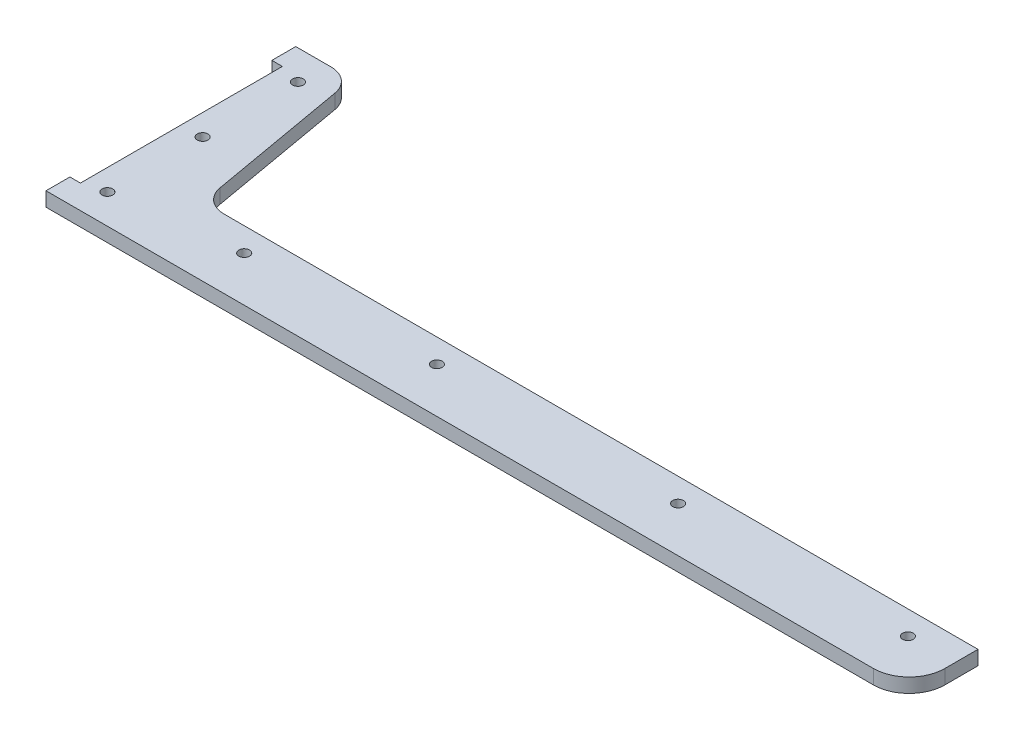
ISO-10303-21;
HEADER;
FILE_DESCRIPTION(('STEP AP214'),'2;1');
FILE_NAME('part.step','',(''),(''),'','','');
FILE_SCHEMA(('AUTOMOTIVE_DESIGN { 1 0 10303 214 1 1 1 1 }'));
ENDSEC;
DATA;
#1=APPLICATION_CONTEXT('core data for automotive mechanical design processes');
#2=APPLICATION_PROTOCOL_DEFINITION('international standard','automotive_design',2000,#1);
#3=PRODUCT_CONTEXT('',#1,'mechanical');
#4=PRODUCT('Part','Part','',(#3));
#5=PRODUCT_RELATED_PRODUCT_CATEGORY('part','',(#4));
#6=PRODUCT_DEFINITION_FORMATION('','',#4);
#7=PRODUCT_DEFINITION_CONTEXT('part definition',#1,'design');
#8=PRODUCT_DEFINITION('design','',#6,#7);
#9=PRODUCT_DEFINITION_SHAPE('','',#8);
#10=(LENGTH_UNIT() NAMED_UNIT(*) SI_UNIT(.MILLI.,.METRE.));
#11=(NAMED_UNIT(*) PLANE_ANGLE_UNIT() SI_UNIT($,.RADIAN.));
#12=(NAMED_UNIT(*) SI_UNIT($,.STERADIAN.) SOLID_ANGLE_UNIT());
#13=UNCERTAINTY_MEASURE_WITH_UNIT(LENGTH_MEASURE(1.E-05),#10,'distance_accuracy_value','');
#14=(GEOMETRIC_REPRESENTATION_CONTEXT(3) GLOBAL_UNCERTAINTY_ASSIGNED_CONTEXT((#13)) GLOBAL_UNIT_ASSIGNED_CONTEXT((#10,
#11,#12)) REPRESENTATION_CONTEXT('',''));
#15=CARTESIAN_POINT('',(0.,0.,0.));
#16=DIRECTION('',(0.,0.,1.));
#17=DIRECTION('',(1.,0.,0.));
#18=AXIS2_PLACEMENT_3D('',#15,#16,#17);
#19=CARTESIAN_POINT('',(0.,2.,0.));
#20=DIRECTION('',(0.,1.,0.));
#21=DIRECTION('',(0.,0.,1.));
#22=AXIS2_PLACEMENT_3D('',#19,#20,#21);
#23=PLANE('',#22);
#24=CARTESIAN_POINT('',(16.,2.,11.));
#25=DIRECTION('',(0.,1.,0.));
#26=DIRECTION('',(0.,0.,1.));
#27=AXIS2_PLACEMENT_3D('',#24,#25,#26);
#28=CIRCLE('',#27,1.5);
#29=CARTESIAN_POINT('',(16.,2.,12.5));
#30=VERTEX_POINT('',#29);
#31=EDGE_CURVE('E250',#30,#30,#28,.F.);
#32=ORIENTED_EDGE('',*,*,#31,.T.);
#33=EDGE_LOOP('',(#32));
#34=FACE_BOUND('',#33,.T.);
#35=CARTESIAN_POINT('',(16.,2.,-15.7));
#36=DIRECTION('',(0.,1.,0.));
#37=DIRECTION('',(0.,0.,1.));
#38=AXIS2_PLACEMENT_3D('',#35,#36,#37);
#39=CIRCLE('',#38,1.5);
#40=CARTESIAN_POINT('',(16.,2.,-14.2));
#41=VERTEX_POINT('',#40);
#42=EDGE_CURVE('E254',#41,#41,#39,.F.);
#43=ORIENTED_EDGE('',*,*,#42,.T.);
#44=EDGE_LOOP('',(#43));
#45=FACE_BOUND('',#44,.T.);
#46=CARTESIAN_POINT('',(16.,2.,-42.4));
#47=DIRECTION('',(0.,1.,0.));
#48=DIRECTION('',(0.,0.,1.));
#49=AXIS2_PLACEMENT_3D('',#46,#47,#48);
#50=CIRCLE('',#49,1.5);
#51=CARTESIAN_POINT('',(16.,2.,-40.9));
#52=VERTEX_POINT('',#51);
#53=EDGE_CURVE('E258',#52,#52,#50,.F.);
#54=ORIENTED_EDGE('',*,*,#53,.T.);
#55=EDGE_LOOP('',(#54));
#56=FACE_BOUND('',#55,.T.);
#57=CARTESIAN_POINT('',(50.,2.,6.65));
#58=DIRECTION('',(0.,1.,0.));
#59=DIRECTION('',(0.,0.,1.));
#60=AXIS2_PLACEMENT_3D('',#57,#58,#59);
#61=CIRCLE('',#60,1.5);
#62=CARTESIAN_POINT('',(50.,2.,8.15));
#63=VERTEX_POINT('',#62);
#64=EDGE_CURVE('E262',#63,#63,#61,.F.);
#65=ORIENTED_EDGE('',*,*,#64,.T.);
#66=EDGE_LOOP('',(#65));
#67=FACE_BOUND('',#66,.T.);
#68=CARTESIAN_POINT('',(104.,2.,6.65));
#69=DIRECTION('',(0.,1.,0.));
#70=DIRECTION('',(0.,0.,1.));
#71=AXIS2_PLACEMENT_3D('',#68,#69,#70);
#72=CIRCLE('',#71,1.5);
#73=CARTESIAN_POINT('',(104.,2.,8.15));
#74=VERTEX_POINT('',#73);
#75=EDGE_CURVE('E266',#74,#74,#72,.F.);
#76=ORIENTED_EDGE('',*,*,#75,.T.);
#77=EDGE_LOOP('',(#76));
#78=FACE_BOUND('',#77,.T.);
#79=CARTESIAN_POINT('',(171.6,2.,6.65));
#80=DIRECTION('',(0.,1.,0.));
#81=DIRECTION('',(0.,0.,1.));
#82=AXIS2_PLACEMENT_3D('',#79,#80,#81);
#83=CIRCLE('',#82,1.5);
#84=CARTESIAN_POINT('',(171.6,2.,8.15));
#85=VERTEX_POINT('',#84);
#86=EDGE_CURVE('E270',#85,#85,#83,.F.);
#87=ORIENTED_EDGE('',*,*,#86,.T.);
#88=EDGE_LOOP('',(#87));
#89=FACE_BOUND('',#88,.T.);
#90=CARTESIAN_POINT('',(236.,2.,6.65));
#91=DIRECTION('',(0.,1.,0.));
#92=DIRECTION('',(0.,0.,1.));
#93=AXIS2_PLACEMENT_3D('',#90,#91,#92);
#94=CIRCLE('',#93,1.5);
#95=CARTESIAN_POINT('',(236.,2.,8.15));
#96=VERTEX_POINT('',#95);
#97=EDGE_CURVE('E159',#96,#96,#94,.F.);
#98=ORIENTED_EDGE('',*,*,#97,.T.);
#99=EDGE_LOOP('',(#98));
#100=FACE_BOUND('',#99,.T.);
#101=DIRECTION('',(-1.,0.,0.));
#102=VECTOR('',#101,1.);
#103=CARTESIAN_POINT('',(249.,2.,0.));
#104=LINE('',#103,#102);
#105=CARTESIAN_POINT('',(37.67369741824,2.,0.));
#106=VERTEX_POINT('',#105);
#107=CARTESIAN_POINT('',(249.,2.,0.));
#108=VERTEX_POINT('',#107);
#109=EDGE_CURVE('E146',#106,#108,#104,.F.);
#110=ORIENTED_EDGE('',*,*,#109,.F.);
#111=CARTESIAN_POINT('',(37.67369741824,2.,-7.));
#112=DIRECTION('',(0.,1.,0.));
#113=DIRECTION('',(0.,0.,1.));
#114=AXIS2_PLACEMENT_3D('',#111,#112,#113);
#115=CIRCLE('',#114,7.);
#116=CARTESIAN_POINT('',(30.7800431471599,2.,-5.7844627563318));
#117=VERTEX_POINT('',#116);
#118=EDGE_CURVE('E20',#106,#117,#115,.F.);
#119=ORIENTED_EDGE('',*,*,#118,.T.);
#120=DIRECTION('',(-0.173648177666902,0.,-0.984807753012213));
#121=VECTOR('',#120,1.);
#122=CARTESIAN_POINT('',(30.78004314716,2.,-5.784462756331));
#123=LINE('',#122,#121);
#124=CARTESIAN_POINT('',(23.880178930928,2.,-44.9155372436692));
#125=VERTEX_POINT('',#124);
#126=EDGE_CURVE('E144',#125,#117,#123,.F.);
#127=ORIENTED_EDGE('',*,*,#126,.F.);
#128=CARTESIAN_POINT('',(16.98652465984,2.,-43.7));
#129=DIRECTION('',(0.,1.,0.));
#130=DIRECTION('',(0.,0.,1.));
#131=AXIS2_PLACEMENT_3D('',#128,#129,#130);
#132=CIRCLE('',#131,7.);
#133=CARTESIAN_POINT('',(16.98652465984,2.,-50.7));
#134=VERTEX_POINT('',#133);
#135=EDGE_CURVE('E280',#134,#125,#132,.F.);
#136=ORIENTED_EDGE('',*,*,#135,.F.);
#137=DIRECTION('',(-1.,0.,0.));
#138=VECTOR('',#137,1.);
#139=CARTESIAN_POINT('',(16.98652465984,2.,-50.7));
#140=LINE('',#139,#138);
#141=CARTESIAN_POINT('',(7.1,2.,-50.7));
#142=VERTEX_POINT('',#141);
#143=EDGE_CURVE('E204',#142,#134,#140,.F.);
#144=ORIENTED_EDGE('',*,*,#143,.F.);
#145=DIRECTION('',(0.,0.,1.));
#146=VECTOR('',#145,1.);
#147=CARTESIAN_POINT('',(7.1,2.,-50.7));
#148=LINE('',#147,#146);
#149=CARTESIAN_POINT('',(7.1,2.,-44.));
#150=VERTEX_POINT('',#149);
#151=EDGE_CURVE('E198',#150,#142,#148,.F.);
#152=ORIENTED_EDGE('',*,*,#151,.F.);
#153=DIRECTION('',(1.,0.,0.));
#154=VECTOR('',#153,1.);
#155=CARTESIAN_POINT('',(7.1,2.,-44.));
#156=LINE('',#155,#154);
#157=CARTESIAN_POINT('',(10.05,2.,-44.));
#158=VERTEX_POINT('',#157);
#159=EDGE_CURVE('E192',#158,#150,#156,.F.);
#160=ORIENTED_EDGE('',*,*,#159,.F.);
#161=DIRECTION('',(0.,0.,1.));
#162=VECTOR('',#161,1.);
#163=CARTESIAN_POINT('',(10.05,2.,-44.));
#164=LINE('',#163,#162);
#165=CARTESIAN_POINT('',(10.05,2.,12.6));
#166=VERTEX_POINT('',#165);
#167=EDGE_CURVE('E186',#166,#158,#164,.F.);
#168=ORIENTED_EDGE('',*,*,#167,.F.);
#169=DIRECTION('',(-1.,0.,0.));
#170=VECTOR('',#169,1.);
#171=CARTESIAN_POINT('',(10.05,2.,12.6));
#172=LINE('',#171,#170);
#173=CARTESIAN_POINT('',(7.1,2.,12.6));
#174=VERTEX_POINT('',#173);
#175=EDGE_CURVE('E180',#174,#166,#172,.F.);
#176=ORIENTED_EDGE('',*,*,#175,.F.);
#177=DIRECTION('',(0.,0.,1.));
#178=VECTOR('',#177,1.);
#179=CARTESIAN_POINT('',(7.1,2.,12.6));
#180=LINE('',#179,#178);
#181=CARTESIAN_POINT('',(7.1,2.,19.3));
#182=VERTEX_POINT('',#181);
#183=EDGE_CURVE('E174',#182,#174,#180,.F.);
#184=ORIENTED_EDGE('',*,*,#183,.F.);
#185=DIRECTION('',(1.,0.,0.));
#186=VECTOR('',#185,1.);
#187=CARTESIAN_POINT('',(7.1,2.,19.3));
#188=LINE('',#187,#186);
#189=CARTESIAN_POINT('',(239.,2.,19.3));
#190=VERTEX_POINT('',#189);
#191=EDGE_CURVE('E167',#190,#182,#188,.F.);
#192=ORIENTED_EDGE('',*,*,#191,.F.);
#193=CARTESIAN_POINT('',(239.,2.,9.3));
#194=DIRECTION('',(0.,1.,0.));
#195=DIRECTION('',(0.,0.,1.));
#196=AXIS2_PLACEMENT_3D('',#193,#194,#195);
#197=CIRCLE('',#196,10.);
#198=CARTESIAN_POINT('',(249.,2.,9.3));
#199=VERTEX_POINT('',#198);
#200=EDGE_CURVE('E277',#199,#190,#197,.F.);
#201=ORIENTED_EDGE('',*,*,#200,.F.);
#202=DIRECTION('',(0.,0.,-1.));
#203=VECTOR('',#202,1.);
#204=CARTESIAN_POINT('',(249.,2.,9.3));
#205=LINE('',#204,#203);
#206=EDGE_CURVE('E153',#108,#199,#205,.F.);
#207=ORIENTED_EDGE('',*,*,#206,.F.);
#208=EDGE_LOOP('',(#110,#119,#127,#136,#144,#152,#160,#168,#176,#184,#192,#201,#207));
#209=FACE_BOUND('',#208,.T.);
#210=ADVANCED_FACE('F17',(#34,#45,#56,#67,#78,#89,#100,#209),#23,.T.);
#211=CARTESIAN_POINT('',(37.67369741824,-2.,-7.));
#212=DIRECTION('',(0.,1.,0.));
#213=DIRECTION('',(0.,0.,1.));
#214=AXIS2_PLACEMENT_3D('',#211,#212,#213);
#215=CYLINDRICAL_SURFACE('',#214,7.);
#216=ORIENTED_EDGE('',*,*,#118,.F.);
#217=DIRECTION('',(0.,1.,0.));
#218=VECTOR('',#217,1.);
#219=CARTESIAN_POINT('',(37.67369741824,-2.,0.));
#220=LINE('',#219,#218);
#221=CARTESIAN_POINT('',(37.67369741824,-2.,0.));
#222=VERTEX_POINT('',#221);
#223=EDGE_CURVE('E138',#222,#106,#220,.T.);
#224=ORIENTED_EDGE('',*,*,#223,.F.);
#225=CARTESIAN_POINT('',(37.67369741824,-2.,-7.));
#226=DIRECTION('',(0.,1.,0.));
#227=DIRECTION('',(0.,0.,1.));
#228=AXIS2_PLACEMENT_3D('',#225,#226,#227);
#229=CIRCLE('',#228,7.);
#230=CARTESIAN_POINT('',(30.7800431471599,-2.,-5.78446275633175));
#231=VERTEX_POINT('',#230);
#232=EDGE_CURVE('E248',#222,#231,#229,.F.);
#233=ORIENTED_EDGE('',*,*,#232,.T.);
#234=DIRECTION('',(0.,1.,0.));
#235=VECTOR('',#234,1.);
#236=CARTESIAN_POINT('',(30.78004314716,-2.,-5.784462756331));
#237=LINE('',#236,#235);
#238=EDGE_CURVE('E139',#117,#231,#237,.F.);
#239=ORIENTED_EDGE('',*,*,#238,.F.);
#240=EDGE_LOOP('',(#216,#224,#233,#239));
#241=FACE_BOUND('',#240,.T.);
#242=ADVANCED_FACE('F136',(#241),#215,.F.);
#243=CARTESIAN_POINT('',(30.78004314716,-2.,-5.784462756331));
#244=DIRECTION('',(0.984807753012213,0.,-0.173648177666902));
#245=DIRECTION('',(-0.173648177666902,0.,-0.984807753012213));
#246=AXIS2_PLACEMENT_3D('',#243,#244,#245);
#247=PLANE('',#246);
#248=ORIENTED_EDGE('',*,*,#238,.T.);
#249=DIRECTION('',(-0.173648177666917,0.,-0.98480775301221));
#250=VECTOR('',#249,1.);
#251=CARTESIAN_POINT('',(30.78004314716,-2.,-5.784462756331));
#252=LINE('',#251,#250);
#253=CARTESIAN_POINT('',(23.8801789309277,-2.,-44.9155372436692));
#254=VERTEX_POINT('',#253);
#255=EDGE_CURVE('E247',#231,#254,#252,.T.);
#256=ORIENTED_EDGE('',*,*,#255,.T.);
#257=DIRECTION('',(0.,1.,0.));
#258=VECTOR('',#257,1.);
#259=CARTESIAN_POINT('',(23.8801789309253,-2.,-44.9155372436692));
#260=LINE('',#259,#258);
#261=EDGE_CURVE('E207',#125,#254,#260,.F.);
#262=ORIENTED_EDGE('',*,*,#261,.F.);
#263=ORIENTED_EDGE('',*,*,#126,.T.);
#264=EDGE_LOOP('',(#248,#256,#262,#263));
#265=FACE_BOUND('',#264,.T.);
#266=ADVANCED_FACE('F373',(#265),#247,.T.);
#267=CARTESIAN_POINT('',(16.98652465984,-2.,-43.7));
#268=DIRECTION('',(0.,1.,0.));
#269=DIRECTION('',(0.,0.,1.));
#270=AXIS2_PLACEMENT_3D('',#267,#268,#269);
#271=CYLINDRICAL_SURFACE('',#270,7.);
#272=ORIENTED_EDGE('',*,*,#261,.T.);
#273=CARTESIAN_POINT('',(16.98652465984,-2.,-43.7));
#274=DIRECTION('',(0.,1.,0.));
#275=DIRECTION('',(0.,0.,1.));
#276=AXIS2_PLACEMENT_3D('',#273,#274,#275);
#277=CIRCLE('',#276,7.);
#278=CARTESIAN_POINT('',(16.98652465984,-2.,-50.7));
#279=VERTEX_POINT('',#278);
#280=EDGE_CURVE('E242',#254,#279,#277,.T.);
#281=ORIENTED_EDGE('',*,*,#280,.T.);
#282=DIRECTION('',(0.,1.,0.));
#283=VECTOR('',#282,1.);
#284=CARTESIAN_POINT('',(16.98652465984,-2.,-50.7));
#285=LINE('',#284,#283);
#286=EDGE_CURVE('E201',#134,#279,#285,.F.);
#287=ORIENTED_EDGE('',*,*,#286,.F.);
#288=ORIENTED_EDGE('',*,*,#135,.T.);
#289=EDGE_LOOP('',(#272,#281,#287,#288));
#290=FACE_BOUND('',#289,.T.);
#291=ADVANCED_FACE('F371',(#290),#271,.T.);
#292=CARTESIAN_POINT('',(16.98652465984,-2.,-50.7));
#293=DIRECTION('',(0.,0.,-1.));
#294=DIRECTION('',(-1.,0.,0.));
#295=AXIS2_PLACEMENT_3D('',#292,#293,#294);
#296=PLANE('',#295);
#297=ORIENTED_EDGE('',*,*,#286,.T.);
#298=DIRECTION('',(1.,0.,0.));
#299=VECTOR('',#298,1.);
#300=CARTESIAN_POINT('',(0.,-2.,-50.7));
#301=LINE('',#300,#299);
#302=CARTESIAN_POINT('',(7.1,-2.,-50.7));
#303=VERTEX_POINT('',#302);
#304=EDGE_CURVE('E246',#279,#303,#301,.F.);
#305=ORIENTED_EDGE('',*,*,#304,.T.);
#306=DIRECTION('',(0.,1.,0.));
#307=VECTOR('',#306,1.);
#308=CARTESIAN_POINT('',(7.1,-2.,-50.7));
#309=LINE('',#308,#307);
#310=EDGE_CURVE('E195',#142,#303,#309,.F.);
#311=ORIENTED_EDGE('',*,*,#310,.F.);
#312=ORIENTED_EDGE('',*,*,#143,.T.);
#313=EDGE_LOOP('',(#297,#305,#311,#312));
#314=FACE_BOUND('',#313,.T.);
#315=ADVANCED_FACE('F360',(#314),#296,.T.);
#316=CARTESIAN_POINT('',(7.1,-2.,-50.7));
#317=DIRECTION('',(-1.,0.,0.));
#318=DIRECTION('',(0.,0.,1.));
#319=AXIS2_PLACEMENT_3D('',#316,#317,#318);
#320=PLANE('',#319);
#321=ORIENTED_EDGE('',*,*,#310,.T.);
#322=DIRECTION('',(0.,0.,1.));
#323=VECTOR('',#322,1.);
#324=CARTESIAN_POINT('',(7.1,-2.,0.));
#325=LINE('',#324,#323);
#326=CARTESIAN_POINT('',(7.1,-2.,-44.));
#327=VERTEX_POINT('',#326);
#328=EDGE_CURVE('E341',#303,#327,#325,.T.);
#329=ORIENTED_EDGE('',*,*,#328,.T.);
#330=DIRECTION('',(0.,1.,0.));
#331=VECTOR('',#330,1.);
#332=CARTESIAN_POINT('',(7.1,-2.,-44.));
#333=LINE('',#332,#331);
#334=EDGE_CURVE('E189',#150,#327,#333,.F.);
#335=ORIENTED_EDGE('',*,*,#334,.F.);
#336=ORIENTED_EDGE('',*,*,#151,.T.);
#337=EDGE_LOOP('',(#321,#329,#335,#336));
#338=FACE_BOUND('',#337,.T.);
#339=ADVANCED_FACE('F424',(#338),#320,.T.);
#340=CARTESIAN_POINT('',(7.1,-2.,-44.));
#341=DIRECTION('',(0.,0.,1.));
#342=DIRECTION('',(1.,0.,0.));
#343=AXIS2_PLACEMENT_3D('',#340,#341,#342);
#344=PLANE('',#343);
#345=ORIENTED_EDGE('',*,*,#334,.T.);
#346=DIRECTION('',(1.,0.,0.));
#347=VECTOR('',#346,1.);
#348=CARTESIAN_POINT('',(0.,-2.,-44.));
#349=LINE('',#348,#347);
#350=CARTESIAN_POINT('',(10.05,-2.,-44.));
#351=VERTEX_POINT('',#350);
#352=EDGE_CURVE('E331',#327,#351,#349,.T.);
#353=ORIENTED_EDGE('',*,*,#352,.T.);
#354=DIRECTION('',(0.,1.,0.));
#355=VECTOR('',#354,1.);
#356=CARTESIAN_POINT('',(10.05,-2.,-44.));
#357=LINE('',#356,#355);
#358=EDGE_CURVE('E183',#158,#351,#357,.F.);
#359=ORIENTED_EDGE('',*,*,#358,.F.);
#360=ORIENTED_EDGE('',*,*,#159,.T.);
#361=EDGE_LOOP('',(#345,#353,#359,#360));
#362=FACE_BOUND('',#361,.T.);
#363=ADVANCED_FACE('F420',(#362),#344,.T.);
#364=CARTESIAN_POINT('',(10.05,-2.,-44.));
#365=DIRECTION('',(-1.,0.,0.));
#366=DIRECTION('',(0.,0.,1.));
#367=AXIS2_PLACEMENT_3D('',#364,#365,#366);
#368=PLANE('',#367);
#369=ORIENTED_EDGE('',*,*,#358,.T.);
#370=DIRECTION('',(0.,0.,1.));
#371=VECTOR('',#370,1.);
#372=CARTESIAN_POINT('',(10.05,-2.,0.));
#373=LINE('',#372,#371);
#374=CARTESIAN_POINT('',(10.05,-2.,12.6));
#375=VERTEX_POINT('',#374);
#376=EDGE_CURVE('E321',#351,#375,#373,.T.);
#377=ORIENTED_EDGE('',*,*,#376,.T.);
#378=DIRECTION('',(0.,1.,0.));
#379=VECTOR('',#378,1.);
#380=CARTESIAN_POINT('',(10.05,-2.,12.6));
#381=LINE('',#380,#379);
#382=EDGE_CURVE('E177',#166,#375,#381,.F.);
#383=ORIENTED_EDGE('',*,*,#382,.F.);
#384=ORIENTED_EDGE('',*,*,#167,.T.);
#385=EDGE_LOOP('',(#369,#377,#383,#384));
#386=FACE_BOUND('',#385,.T.);
#387=ADVANCED_FACE('F416',(#386),#368,.T.);
#388=CARTESIAN_POINT('',(10.05,-2.,12.6));
#389=DIRECTION('',(0.,0.,-1.));
#390=DIRECTION('',(-1.,0.,0.));
#391=AXIS2_PLACEMENT_3D('',#388,#389,#390);
#392=PLANE('',#391);
#393=ORIENTED_EDGE('',*,*,#382,.T.);
#394=DIRECTION('',(1.,0.,0.));
#395=VECTOR('',#394,1.);
#396=CARTESIAN_POINT('',(0.,-2.,12.6));
#397=LINE('',#396,#395);
#398=CARTESIAN_POINT('',(7.1,-2.,12.6));
#399=VERTEX_POINT('',#398);
#400=EDGE_CURVE('E311',#375,#399,#397,.F.);
#401=ORIENTED_EDGE('',*,*,#400,.T.);
#402=DIRECTION('',(0.,1.,0.));
#403=VECTOR('',#402,1.);
#404=CARTESIAN_POINT('',(7.1,-2.,12.6));
#405=LINE('',#404,#403);
#406=EDGE_CURVE('E171',#174,#399,#405,.F.);
#407=ORIENTED_EDGE('',*,*,#406,.F.);
#408=ORIENTED_EDGE('',*,*,#175,.T.);
#409=EDGE_LOOP('',(#393,#401,#407,#408));
#410=FACE_BOUND('',#409,.T.);
#411=ADVANCED_FACE('F411',(#410),#392,.T.);
#412=CARTESIAN_POINT('',(7.1,-2.,12.6));
#413=DIRECTION('',(-1.,0.,0.));
#414=DIRECTION('',(0.,0.,1.));
#415=AXIS2_PLACEMENT_3D('',#412,#413,#414);
#416=PLANE('',#415);
#417=ORIENTED_EDGE('',*,*,#406,.T.);
#418=DIRECTION('',(0.,0.,1.));
#419=VECTOR('',#418,1.);
#420=CARTESIAN_POINT('',(7.1,-2.,0.));
#421=LINE('',#420,#419);
#422=CARTESIAN_POINT('',(7.1,-2.,19.3));
#423=VERTEX_POINT('',#422);
#424=EDGE_CURVE('E307',#399,#423,#421,.T.);
#425=ORIENTED_EDGE('',*,*,#424,.T.);
#426=DIRECTION('',(0.,1.,0.));
#427=VECTOR('',#426,1.);
#428=CARTESIAN_POINT('',(7.1,-2.,19.3));
#429=LINE('',#428,#427);
#430=EDGE_CURVE('E170',#182,#423,#429,.F.);
#431=ORIENTED_EDGE('',*,*,#430,.F.);
#432=ORIENTED_EDGE('',*,*,#183,.T.);
#433=EDGE_LOOP('',(#417,#425,#431,#432));
#434=FACE_BOUND('',#433,.T.);
#435=ADVANCED_FACE('F408',(#434),#416,.T.);
#436=CARTESIAN_POINT('',(7.1,-2.,19.3));
#437=DIRECTION('',(0.,0.,1.));
#438=DIRECTION('',(1.,0.,0.));
#439=AXIS2_PLACEMENT_3D('',#436,#437,#438);
#440=PLANE('',#439);
#441=ORIENTED_EDGE('',*,*,#430,.T.);
#442=DIRECTION('',(1.,0.,0.));
#443=VECTOR('',#442,1.);
#444=CARTESIAN_POINT('',(0.,-2.,19.3));
#445=LINE('',#444,#443);
#446=CARTESIAN_POINT('',(239.,-2.,19.3));
#447=VERTEX_POINT('',#446);
#448=EDGE_CURVE('E241',#423,#447,#445,.T.);
#449=ORIENTED_EDGE('',*,*,#448,.T.);
#450=DIRECTION('',(0.,1.,0.));
#451=VECTOR('',#450,1.);
#452=CARTESIAN_POINT('',(239.,-2.,19.3));
#453=LINE('',#452,#451);
#454=EDGE_CURVE('E279',#190,#447,#453,.F.);
#455=ORIENTED_EDGE('',*,*,#454,.F.);
#456=ORIENTED_EDGE('',*,*,#191,.T.);
#457=EDGE_LOOP('',(#441,#449,#455,#456));
#458=FACE_BOUND('',#457,.T.);
#459=ADVANCED_FACE('F404',(#458),#440,.T.);
#460=CARTESIAN_POINT('',(239.,-2.,9.3));
#461=DIRECTION('',(0.,1.,0.));
#462=DIRECTION('',(0.,0.,1.));
#463=AXIS2_PLACEMENT_3D('',#460,#461,#462);
#464=CYLINDRICAL_SURFACE('',#463,10.);
#465=ORIENTED_EDGE('',*,*,#454,.T.);
#466=CARTESIAN_POINT('',(239.,-2.,9.3));
#467=DIRECTION('',(0.,1.,0.));
#468=DIRECTION('',(0.,0.,1.));
#469=AXIS2_PLACEMENT_3D('',#466,#467,#468);
#470=CIRCLE('',#469,10.);
#471=CARTESIAN_POINT('',(249.,-2.,9.3));
#472=VERTEX_POINT('',#471);
#473=EDGE_CURVE('E236',#447,#472,#470,.T.);
#474=ORIENTED_EDGE('',*,*,#473,.T.);
#475=DIRECTION('',(0.,1.,0.));
#476=VECTOR('',#475,1.);
#477=CARTESIAN_POINT('',(249.,-2.,9.3));
#478=LINE('',#477,#476);
#479=EDGE_CURVE('E150',#199,#472,#478,.F.);
#480=ORIENTED_EDGE('',*,*,#479,.F.);
#481=ORIENTED_EDGE('',*,*,#200,.T.);
#482=EDGE_LOOP('',(#465,#474,#480,#481));
#483=FACE_BOUND('',#482,.T.);
#484=ADVANCED_FACE('F398',(#483),#464,.T.);
#485=CARTESIAN_POINT('',(249.,-2.,9.3));
#486=DIRECTION('',(1.,0.,0.));
#487=DIRECTION('',(0.,0.,-1.));
#488=AXIS2_PLACEMENT_3D('',#485,#486,#487);
#489=PLANE('',#488);
#490=ORIENTED_EDGE('',*,*,#479,.T.);
#491=DIRECTION('',(0.,0.,1.));
#492=VECTOR('',#491,1.);
#493=CARTESIAN_POINT('',(249.,-2.,0.));
#494=LINE('',#493,#492);
#495=CARTESIAN_POINT('',(249.,-2.,0.));
#496=VERTEX_POINT('',#495);
#497=EDGE_CURVE('E240',#472,#496,#494,.F.);
#498=ORIENTED_EDGE('',*,*,#497,.T.);
#499=DIRECTION('',(0.,1.,0.));
#500=VECTOR('',#499,1.);
#501=CARTESIAN_POINT('',(249.,-2.,0.));
#502=LINE('',#501,#500);
#503=EDGE_CURVE('E40',#108,#496,#502,.F.);
#504=ORIENTED_EDGE('',*,*,#503,.F.);
#505=ORIENTED_EDGE('',*,*,#206,.T.);
#506=EDGE_LOOP('',(#490,#498,#504,#505));
#507=FACE_BOUND('',#506,.T.);
#508=ADVANCED_FACE('F395',(#507),#489,.T.);
#509=CARTESIAN_POINT('',(249.,-2.,0.));
#510=DIRECTION('',(0.,0.,-1.));
#511=DIRECTION('',(-1.,0.,0.));
#512=AXIS2_PLACEMENT_3D('',#509,#510,#511);
#513=PLANE('',#512);
#514=ORIENTED_EDGE('',*,*,#503,.T.);
#515=DIRECTION('',(1.,0.,0.));
#516=VECTOR('',#515,1.);
#517=CARTESIAN_POINT('',(0.,-2.,0.));
#518=LINE('',#517,#516);
#519=EDGE_CURVE('E148',#496,#222,#518,.F.);
#520=ORIENTED_EDGE('',*,*,#519,.T.);
#521=ORIENTED_EDGE('',*,*,#223,.T.);
#522=ORIENTED_EDGE('',*,*,#109,.T.);
#523=EDGE_LOOP('',(#514,#520,#521,#522));
#524=FACE_BOUND('',#523,.T.);
#525=ADVANCED_FACE('F145',(#524),#513,.T.);
#526=CARTESIAN_POINT('',(236.,-2.,6.65));
#527=DIRECTION('',(0.,1.,0.));
#528=DIRECTION('',(0.,0.,1.));
#529=AXIS2_PLACEMENT_3D('',#526,#527,#528);
#530=CYLINDRICAL_SURFACE('',#529,1.5);
#531=ORIENTED_EDGE('',*,*,#97,.F.);
#532=EDGE_LOOP('',(#531));
#533=FACE_BOUND('',#532,.T.);
#534=CARTESIAN_POINT('',(236.,-2.,6.65));
#535=DIRECTION('',(0.,1.,0.));
#536=DIRECTION('',(0.,0.,1.));
#537=AXIS2_PLACEMENT_3D('',#534,#535,#536);
#538=CIRCLE('',#537,1.5);
#539=CARTESIAN_POINT('',(236.,-2.,8.15));
#540=VERTEX_POINT('',#539);
#541=EDGE_CURVE('E232',#540,#540,#538,.F.);
#542=ORIENTED_EDGE('',*,*,#541,.T.);
#543=EDGE_LOOP('',(#542));
#544=FACE_BOUND('',#543,.T.);
#545=ADVANCED_FACE('F466',(#533,#544),#530,.F.);
#546=CARTESIAN_POINT('',(171.6,-2.,6.65));
#547=DIRECTION('',(0.,1.,0.));
#548=DIRECTION('',(0.,0.,1.));
#549=AXIS2_PLACEMENT_3D('',#546,#547,#548);
#550=CYLINDRICAL_SURFACE('',#549,1.5);
#551=ORIENTED_EDGE('',*,*,#86,.F.);
#552=EDGE_LOOP('',(#551));
#553=FACE_BOUND('',#552,.T.);
#554=CARTESIAN_POINT('',(171.6,-2.,6.65));
#555=DIRECTION('',(0.,1.,0.));
#556=DIRECTION('',(0.,0.,1.));
#557=AXIS2_PLACEMENT_3D('',#554,#555,#556);
#558=CIRCLE('',#557,1.5);
#559=CARTESIAN_POINT('',(171.6,-2.,8.15));
#560=VERTEX_POINT('',#559);
#561=EDGE_CURVE('E228',#560,#560,#558,.F.);
#562=ORIENTED_EDGE('',*,*,#561,.T.);
#563=EDGE_LOOP('',(#562));
#564=FACE_BOUND('',#563,.T.);
#565=ADVANCED_FACE('F462',(#553,#564),#550,.F.);
#566=CARTESIAN_POINT('',(104.,-2.,6.65));
#567=DIRECTION('',(0.,1.,0.));
#568=DIRECTION('',(0.,0.,1.));
#569=AXIS2_PLACEMENT_3D('',#566,#567,#568);
#570=CYLINDRICAL_SURFACE('',#569,1.5);
#571=ORIENTED_EDGE('',*,*,#75,.F.);
#572=EDGE_LOOP('',(#571));
#573=FACE_BOUND('',#572,.T.);
#574=CARTESIAN_POINT('',(104.,-2.,6.65));
#575=DIRECTION('',(0.,1.,0.));
#576=DIRECTION('',(0.,0.,1.));
#577=AXIS2_PLACEMENT_3D('',#574,#575,#576);
#578=CIRCLE('',#577,1.5);
#579=CARTESIAN_POINT('',(104.,-2.,8.15));
#580=VERTEX_POINT('',#579);
#581=EDGE_CURVE('E224',#580,#580,#578,.F.);
#582=ORIENTED_EDGE('',*,*,#581,.T.);
#583=EDGE_LOOP('',(#582));
#584=FACE_BOUND('',#583,.T.);
#585=ADVANCED_FACE('F458',(#573,#584),#570,.F.);
#586=CARTESIAN_POINT('',(50.,-2.,6.65));
#587=DIRECTION('',(0.,1.,0.));
#588=DIRECTION('',(0.,0.,1.));
#589=AXIS2_PLACEMENT_3D('',#586,#587,#588);
#590=CYLINDRICAL_SURFACE('',#589,1.5);
#591=ORIENTED_EDGE('',*,*,#64,.F.);
#592=EDGE_LOOP('',(#591));
#593=FACE_BOUND('',#592,.T.);
#594=CARTESIAN_POINT('',(50.,-2.,6.65));
#595=DIRECTION('',(0.,1.,0.));
#596=DIRECTION('',(0.,0.,1.));
#597=AXIS2_PLACEMENT_3D('',#594,#595,#596);
#598=CIRCLE('',#597,1.5);
#599=CARTESIAN_POINT('',(50.,-2.,8.15));
#600=VERTEX_POINT('',#599);
#601=EDGE_CURVE('E220',#600,#600,#598,.F.);
#602=ORIENTED_EDGE('',*,*,#601,.T.);
#603=EDGE_LOOP('',(#602));
#604=FACE_BOUND('',#603,.T.);
#605=ADVANCED_FACE('F454',(#593,#604),#590,.F.);
#606=CARTESIAN_POINT('',(16.,-2.,-42.4));
#607=DIRECTION('',(0.,1.,0.));
#608=DIRECTION('',(0.,0.,1.));
#609=AXIS2_PLACEMENT_3D('',#606,#607,#608);
#610=CYLINDRICAL_SURFACE('',#609,1.5);
#611=ORIENTED_EDGE('',*,*,#53,.F.);
#612=EDGE_LOOP('',(#611));
#613=FACE_BOUND('',#612,.T.);
#614=CARTESIAN_POINT('',(16.,-2.,-42.4));
#615=DIRECTION('',(0.,1.,0.));
#616=DIRECTION('',(0.,0.,1.));
#617=AXIS2_PLACEMENT_3D('',#614,#615,#616);
#618=CIRCLE('',#617,1.5);
#619=CARTESIAN_POINT('',(16.,-2.,-40.9));
#620=VERTEX_POINT('',#619);
#621=EDGE_CURVE('E216',#620,#620,#618,.F.);
#622=ORIENTED_EDGE('',*,*,#621,.T.);
#623=EDGE_LOOP('',(#622));
#624=FACE_BOUND('',#623,.T.);
#625=ADVANCED_FACE('F450',(#613,#624),#610,.F.);
#626=CARTESIAN_POINT('',(16.,-2.,-15.7));
#627=DIRECTION('',(0.,1.,0.));
#628=DIRECTION('',(0.,0.,1.));
#629=AXIS2_PLACEMENT_3D('',#626,#627,#628);
#630=CYLINDRICAL_SURFACE('',#629,1.5);
#631=ORIENTED_EDGE('',*,*,#42,.F.);
#632=EDGE_LOOP('',(#631));
#633=FACE_BOUND('',#632,.T.);
#634=CARTESIAN_POINT('',(16.,-2.,-15.7));
#635=DIRECTION('',(0.,1.,0.));
#636=DIRECTION('',(0.,0.,1.));
#637=AXIS2_PLACEMENT_3D('',#634,#635,#636);
#638=CIRCLE('',#637,1.5);
#639=CARTESIAN_POINT('',(16.,-2.,-14.2));
#640=VERTEX_POINT('',#639);
#641=EDGE_CURVE('E27',#640,#640,#638,.F.);
#642=ORIENTED_EDGE('',*,*,#641,.T.);
#643=EDGE_LOOP('',(#642));
#644=FACE_BOUND('',#643,.T.);
#645=ADVANCED_FACE('F442',(#633,#644),#630,.F.);
#646=CARTESIAN_POINT('',(16.,-2.,11.));
#647=DIRECTION('',(0.,1.,0.));
#648=DIRECTION('',(0.,0.,1.));
#649=AXIS2_PLACEMENT_3D('',#646,#647,#648);
#650=CYLINDRICAL_SURFACE('',#649,1.5);
#651=ORIENTED_EDGE('',*,*,#31,.F.);
#652=EDGE_LOOP('',(#651));
#653=FACE_BOUND('',#652,.T.);
#654=CARTESIAN_POINT('',(16.,-2.,11.));
#655=DIRECTION('',(0.,1.,0.));
#656=DIRECTION('',(0.,0.,1.));
#657=AXIS2_PLACEMENT_3D('',#654,#655,#656);
#658=CIRCLE('',#657,1.5);
#659=CARTESIAN_POINT('',(16.,-2.,12.5));
#660=VERTEX_POINT('',#659);
#661=EDGE_CURVE('E11',#660,#660,#658,.F.);
#662=ORIENTED_EDGE('',*,*,#661,.T.);
#663=EDGE_LOOP('',(#662));
#664=FACE_BOUND('',#663,.T.);
#665=ADVANCED_FACE('F435',(#653,#664),#650,.F.);
#666=CARTESIAN_POINT('',(0.,-2.,0.));
#667=DIRECTION('',(0.,1.,0.));
#668=DIRECTION('',(0.,0.,1.));
#669=AXIS2_PLACEMENT_3D('',#666,#667,#668);
#670=PLANE('',#669);
#671=ORIENTED_EDGE('',*,*,#661,.F.);
#672=EDGE_LOOP('',(#671));
#673=FACE_BOUND('',#672,.T.);
#674=ORIENTED_EDGE('',*,*,#641,.F.);
#675=EDGE_LOOP('',(#674));
#676=FACE_BOUND('',#675,.T.);
#677=ORIENTED_EDGE('',*,*,#621,.F.);
#678=EDGE_LOOP('',(#677));
#679=FACE_BOUND('',#678,.T.);
#680=ORIENTED_EDGE('',*,*,#601,.F.);
#681=EDGE_LOOP('',(#680));
#682=FACE_BOUND('',#681,.T.);
#683=ORIENTED_EDGE('',*,*,#581,.F.);
#684=EDGE_LOOP('',(#683));
#685=FACE_BOUND('',#684,.T.);
#686=ORIENTED_EDGE('',*,*,#561,.F.);
#687=EDGE_LOOP('',(#686));
#688=FACE_BOUND('',#687,.T.);
#689=ORIENTED_EDGE('',*,*,#541,.F.);
#690=EDGE_LOOP('',(#689));
#691=FACE_BOUND('',#690,.T.);
#692=ORIENTED_EDGE('',*,*,#497,.F.);
#693=ORIENTED_EDGE('',*,*,#473,.F.);
#694=ORIENTED_EDGE('',*,*,#448,.F.);
#695=ORIENTED_EDGE('',*,*,#424,.F.);
#696=ORIENTED_EDGE('',*,*,#400,.F.);
#697=ORIENTED_EDGE('',*,*,#376,.F.);
#698=ORIENTED_EDGE('',*,*,#352,.F.);
#699=ORIENTED_EDGE('',*,*,#328,.F.);
#700=ORIENTED_EDGE('',*,*,#304,.F.);
#701=ORIENTED_EDGE('',*,*,#280,.F.);
#702=ORIENTED_EDGE('',*,*,#255,.F.);
#703=ORIENTED_EDGE('',*,*,#232,.F.);
#704=ORIENTED_EDGE('',*,*,#519,.F.);
#705=EDGE_LOOP('',(#692,#693,#694,#695,#696,#697,#698,#699,#700,#701,#702,#703,#704));
#706=FACE_BOUND('',#705,.T.);
#707=ADVANCED_FACE('F367',(#673,#676,#679,#682,#685,#688,#691,#706),#670,.F.);
#708=CLOSED_SHELL('',(#210,#242,#266,#291,#315,#339,#363,#387,#411,#435,#459,#484,#508,#525,
#545,#565,#585,#605,#625,#645,#665,#707));
#709=MANIFOLD_SOLID_BREP('B1',#708);
#710=ADVANCED_BREP_SHAPE_REPRESENTATION('',(#18,#709),#14);
#711=SHAPE_DEFINITION_REPRESENTATION(#9,#710);
ENDSEC;
END-ISO-10303-21;
